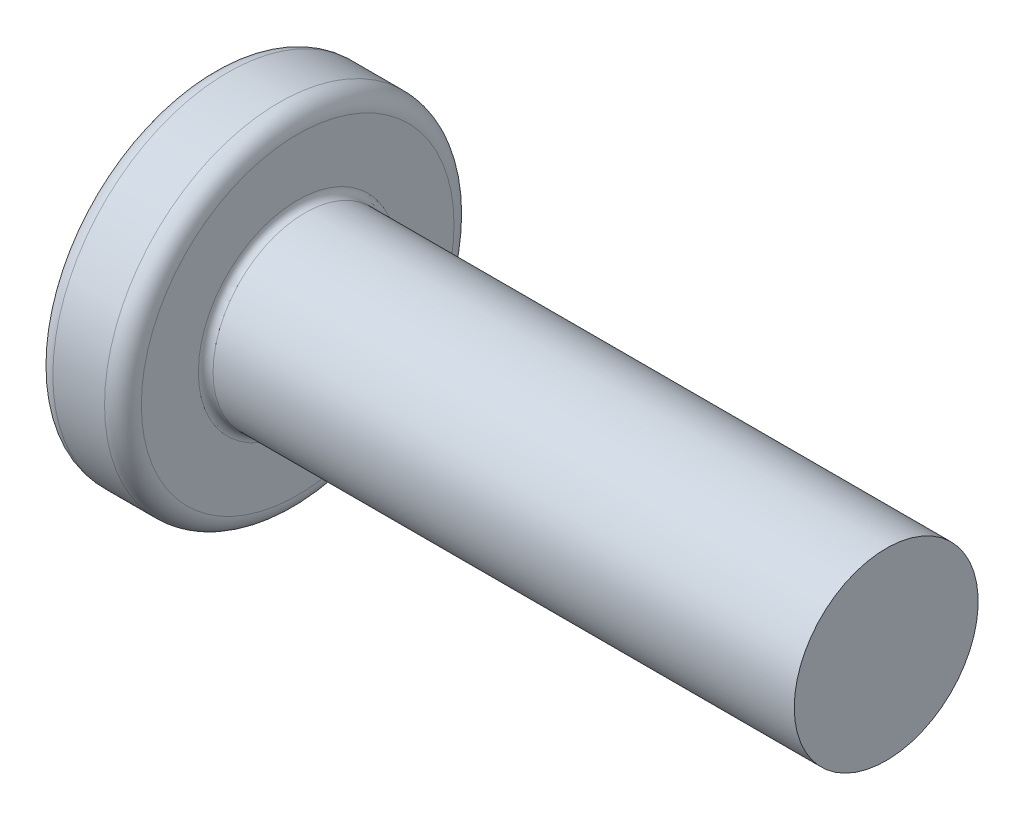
ISO-10303-21;
HEADER;
FILE_DESCRIPTION(('STEP AP214'),'2;1');
FILE_NAME('part.step','',(''),(''),'','','');
FILE_SCHEMA(('AUTOMOTIVE_DESIGN { 1 0 10303 214 1 1 1 1 }'));
ENDSEC;
DATA;
#1=APPLICATION_CONTEXT('core data for automotive mechanical design processes');
#2=APPLICATION_PROTOCOL_DEFINITION('international standard','automotive_design',2000,#1);
#3=PRODUCT_CONTEXT('',#1,'mechanical');
#4=PRODUCT('Part','Part','',(#3));
#5=PRODUCT_RELATED_PRODUCT_CATEGORY('part','',(#4));
#6=PRODUCT_DEFINITION_FORMATION('','',#4);
#7=PRODUCT_DEFINITION_CONTEXT('part definition',#1,'design');
#8=PRODUCT_DEFINITION('design','',#6,#7);
#9=PRODUCT_DEFINITION_SHAPE('','',#8);
#10=(LENGTH_UNIT() NAMED_UNIT(*) SI_UNIT(.MILLI.,.METRE.));
#11=(NAMED_UNIT(*) PLANE_ANGLE_UNIT() SI_UNIT($,.RADIAN.));
#12=(NAMED_UNIT(*) SI_UNIT($,.STERADIAN.) SOLID_ANGLE_UNIT());
#13=UNCERTAINTY_MEASURE_WITH_UNIT(LENGTH_MEASURE(1.E-05),#10,'distance_accuracy_value','');
#14=(GEOMETRIC_REPRESENTATION_CONTEXT(3) GLOBAL_UNCERTAINTY_ASSIGNED_CONTEXT((#13)) GLOBAL_UNIT_ASSIGNED_CONTEXT((#10,
#11,#12)) REPRESENTATION_CONTEXT('',''));
#15=CARTESIAN_POINT('',(0.,0.,0.));
#16=DIRECTION('',(0.,0.,1.));
#17=DIRECTION('',(1.,0.,0.));
#18=AXIS2_PLACEMENT_3D('',#15,#16,#17);
#19=CARTESIAN_POINT('',(8.,0.,0.));
#20=DIRECTION('',(-1.,0.,0.));
#21=DIRECTION('',(0.,1.,0.));
#22=AXIS2_PLACEMENT_3D('',#19,#20,#21);
#23=SPHERICAL_SURFACE('',#22,8.);
#24=CARTESIAN_POINT('',(1.42427123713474,0.,0.));
#25=DIRECTION('',(-1.,0.,0.));
#26=DIRECTION('',(0.,0.,1.));
#27=AXIS2_PLACEMENT_3D('',#24,#25,#26);
#28=CIRCLE('',#27,4.55629139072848);
#29=CARTESIAN_POINT('',(1.42427123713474,0.,4.55629139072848));
#30=VERTEX_POINT('',#29);
#31=EDGE_CURVE('E214',#30,#30,#28,.T.);
#32=ORIENTED_EDGE('',*,*,#31,.T.);
#33=EDGE_LOOP('',(#32));
#34=FACE_BOUND('',#33,.T.);
#35=CARTESIAN_POINT('',(0.0676093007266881,0.,0.));
#36=DIRECTION('',(1.,0.,0.));
#37=DIRECTION('',(0.,0.,-1.));
#38=AXIS2_PLACEMENT_3D('',#35,#36,#37);
#39=CIRCLE('',#38,1.03787176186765);
#40=CARTESIAN_POINT('',(0.0676093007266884,-0.514999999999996,-0.901084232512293));
#41=VERTEX_POINT('',#40);
#42=CARTESIAN_POINT('',(0.0676093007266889,-0.901084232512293,-0.515));
#43=VERTEX_POINT('',#42);
#44=EDGE_CURVE('E397',#41,#43,#39,.F.);
#45=ORIENTED_EDGE('',*,*,#44,.F.);
#46=CARTESIAN_POINT('',(8.,-0.515,0.));
#47=DIRECTION('',(0.,1.,0.));
#48=DIRECTION('',(0.,0.,1.));
#49=AXIS2_PLACEMENT_3D('',#46,#47,#48);
#50=CIRCLE('',#49,7.98340622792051);
#51=CARTESIAN_POINT('',(0.322606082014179,-0.514999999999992,-2.18915454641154));
#52=VERTEX_POINT('',#51);
#53=EDGE_CURVE('E356',#52,#41,#50,.T.);
#54=ORIENTED_EDGE('',*,*,#53,.F.);
#55=CARTESIAN_POINT('',(7.34565688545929,0.,1.31240929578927));
#56=DIRECTION('',(0.446197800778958,0.,-0.89493436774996));
#57=DIRECTION('',(-0.89493436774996,0.,-0.446197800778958));
#58=AXIS2_PLACEMENT_3D('',#55,#56,#57);
#59=CIRCLE('',#58,7.86444002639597);
#60=CARTESIAN_POINT('',(0.322606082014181,0.515000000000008,-2.18915454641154));
#61=VERTEX_POINT('',#60);
#62=EDGE_CURVE('E230',#52,#61,#59,.T.);
#63=ORIENTED_EDGE('',*,*,#62,.T.);
#64=CARTESIAN_POINT('',(8.,0.515,0.));
#65=DIRECTION('',(0.,-1.,0.));
#66=DIRECTION('',(0.,0.,-1.));
#67=AXIS2_PLACEMENT_3D('',#64,#65,#66);
#68=CIRCLE('',#67,7.98340622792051);
#69=CARTESIAN_POINT('',(0.0676093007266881,0.515000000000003,-0.901084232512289));
#70=VERTEX_POINT('',#69);
#71=EDGE_CURVE('E355',#70,#61,#68,.T.);
#72=ORIENTED_EDGE('',*,*,#71,.F.);
#73=CARTESIAN_POINT('',(0.0676093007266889,0.901084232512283,-0.515));
#74=VERTEX_POINT('',#73);
#75=EDGE_CURVE('E399',#74,#70,#39,.F.);
#76=ORIENTED_EDGE('',*,*,#75,.F.);
#77=CARTESIAN_POINT('',(8.,0.,-0.515));
#78=DIRECTION('',(0.,0.,1.));
#79=DIRECTION('',(1.,0.,0.));
#80=AXIS2_PLACEMENT_3D('',#77,#78,#79);
#81=CIRCLE('',#80,7.98340622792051);
#82=CARTESIAN_POINT('',(0.32260608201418,2.18915454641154,-0.515));
#83=VERTEX_POINT('',#82);
#84=EDGE_CURVE('E224',#83,#74,#81,.T.);
#85=ORIENTED_EDGE('',*,*,#84,.F.);
#86=CARTESIAN_POINT('',(7.34565688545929,-1.31240929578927,0.));
#87=DIRECTION('',(0.446197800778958,0.89493436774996,0.));
#88=DIRECTION('',(-0.89493436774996,0.446197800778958,0.));
#89=AXIS2_PLACEMENT_3D('',#86,#87,#88);
#90=CIRCLE('',#89,7.86444002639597);
#91=CARTESIAN_POINT('',(0.322606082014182,2.18915454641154,0.514999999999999));
#92=VERTEX_POINT('',#91);
#93=EDGE_CURVE('E227',#83,#92,#90,.T.);
#94=ORIENTED_EDGE('',*,*,#93,.T.);
#95=CARTESIAN_POINT('',(8.,0.,0.515));
#96=DIRECTION('',(0.,0.,-1.));
#97=DIRECTION('',(0.,1.,0.));
#98=AXIS2_PLACEMENT_3D('',#95,#96,#97);
#99=CIRCLE('',#98,7.98340622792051);
#100=CARTESIAN_POINT('',(0.0676093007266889,0.901084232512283,0.515));
#101=VERTEX_POINT('',#100);
#102=EDGE_CURVE('E220',#101,#92,#99,.T.);
#103=ORIENTED_EDGE('',*,*,#102,.F.);
#104=CARTESIAN_POINT('',(0.067609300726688,0.514999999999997,0.901084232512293));
#105=VERTEX_POINT('',#104);
#106=EDGE_CURVE('E403',#105,#101,#39,.F.);
#107=ORIENTED_EDGE('',*,*,#106,.F.);
#108=CARTESIAN_POINT('',(0.322606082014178,0.514999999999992,2.18915454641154));
#109=VERTEX_POINT('',#108);
#110=EDGE_CURVE('E352',#109,#105,#68,.T.);
#111=ORIENTED_EDGE('',*,*,#110,.F.);
#112=CARTESIAN_POINT('',(7.34565688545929,0.,-1.31240929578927));
#113=DIRECTION('',(0.446197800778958,0.,0.89493436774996));
#114=DIRECTION('',(0.89493436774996,0.,-0.446197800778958));
#115=AXIS2_PLACEMENT_3D('',#112,#113,#114);
#116=CIRCLE('',#115,7.86444002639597);
#117=CARTESIAN_POINT('',(0.32260608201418,-0.515000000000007,2.18915454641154));
#118=VERTEX_POINT('',#117);
#119=EDGE_CURVE('E233',#109,#118,#116,.T.);
#120=ORIENTED_EDGE('',*,*,#119,.T.);
#121=CARTESIAN_POINT('',(0.0676093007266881,-0.515000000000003,0.901084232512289));
#122=VERTEX_POINT('',#121);
#123=EDGE_CURVE('E357',#122,#118,#50,.T.);
#124=ORIENTED_EDGE('',*,*,#123,.F.);
#125=CARTESIAN_POINT('',(0.0676093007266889,-0.901084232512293,0.514999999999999));
#126=VERTEX_POINT('',#125);
#127=EDGE_CURVE('E289',#126,#122,#39,.F.);
#128=ORIENTED_EDGE('',*,*,#127,.F.);
#129=CARTESIAN_POINT('',(0.322606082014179,-2.18915454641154,0.514999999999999));
#130=VERTEX_POINT('',#129);
#131=EDGE_CURVE('E221',#130,#126,#99,.T.);
#132=ORIENTED_EDGE('',*,*,#131,.F.);
#133=CARTESIAN_POINT('',(7.34565688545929,1.31240929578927,0.));
#134=DIRECTION('',(0.446197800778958,-0.89493436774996,0.));
#135=DIRECTION('',(0.89493436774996,0.446197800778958,0.));
#136=AXIS2_PLACEMENT_3D('',#133,#134,#135);
#137=CIRCLE('',#136,7.86444002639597);
#138=CARTESIAN_POINT('',(0.322606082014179,-2.18915454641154,-0.515));
#139=VERTEX_POINT('',#138);
#140=EDGE_CURVE('E211',#130,#139,#137,.T.);
#141=ORIENTED_EDGE('',*,*,#140,.T.);
#142=EDGE_CURVE('E60',#43,#139,#81,.T.);
#143=ORIENTED_EDGE('',*,*,#142,.F.);
#144=EDGE_LOOP('',(#45,#54,#63,#72,#76,#85,#94,#103,#107,#111,#120,#124,#128,#132,#141,#143));
#145=FACE_BOUND('',#144,.T.);
#146=ADVANCED_FACE('F37',(#34,#145),#23,.T.);
#147=CARTESIAN_POINT('',(0.,2.35,-0.515));
#148=DIRECTION('',(0.,0.,1.));
#149=DIRECTION('',(1.,0.,0.));
#150=AXIS2_PLACEMENT_3D('',#147,#148,#149);
#151=PLANE('',#150);
#152=ORIENTED_EDGE('',*,*,#84,.T.);
#153=CARTESIAN_POINT('',(-1.51390484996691,1.02651837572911,-0.515));
#154=CARTESIAN_POINT('',(-1.19828075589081,1.00181934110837,-0.515));
#155=CARTESIAN_POINT('',(-0.882669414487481,0.976954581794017,-0.515));
#156=CARTESIAN_POINT('',(-0.251463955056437,0.926774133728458,-0.515));
#157=CARTESIAN_POINT('',(0.0641301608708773,0.901458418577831,-0.515));
#158=CARTESIAN_POINT('',(0.537487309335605,0.863059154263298,-0.515));
#159=CARTESIAN_POINT('',(0.695267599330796,0.850188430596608,-0.515));
#160=CARTESIAN_POINT('',(1.01081295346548,0.824283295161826,-0.515));
#161=CARTESIAN_POINT('',(1.16857801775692,0.811248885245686,-0.515));
#162=CARTESIAN_POINT('',(1.48408237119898,0.784992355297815,-0.515));
#163=CARTESIAN_POINT('',(1.64182166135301,0.771770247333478,-0.515));
#164=CARTESIAN_POINT('',(1.95728793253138,0.7451057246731,-0.515));
#165=CARTESIAN_POINT('',(2.11501491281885,0.731663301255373,-0.515));
#166=CARTESIAN_POINT('',(2.48551875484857,0.699781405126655,-0.515));
#167=CARTESIAN_POINT('',(2.69828652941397,0.681236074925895,-0.515));
#168=CARTESIAN_POINT('',(3.12376344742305,0.643549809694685,-0.515));
#169=CARTESIAN_POINT('',(3.33647259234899,0.624408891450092,-0.515));
#170=CARTESIAN_POINT('',(3.76177021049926,0.585350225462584,-0.515));
#171=CARTESIAN_POINT('',(3.97435870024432,0.565432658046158,-0.515));
#172=CARTESIAN_POINT('',(4.39945864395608,0.524537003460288,-0.515));
#173=CARTESIAN_POINT('',(4.61197008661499,0.503558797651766,-0.515));
#174=CARTESIAN_POINT('',(4.93071637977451,0.470931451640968,-0.515));
#175=CARTESIAN_POINT('',(5.03701000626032,0.459857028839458,-0.515));
#176=CARTESIAN_POINT('',(5.24954252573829,0.437229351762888,-0.515));
#177=CARTESIAN_POINT('',(5.35578142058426,0.425676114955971,-0.515));
#178=CARTESIAN_POINT('',(5.56815317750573,0.401967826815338,-0.515));
#179=CARTESIAN_POINT('',(5.6742860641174,0.389812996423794,-0.515));
#180=CARTESIAN_POINT('',(5.88647145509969,0.364705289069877,-0.515));
#181=CARTESIAN_POINT('',(5.99252394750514,0.35175231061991,-0.515));
#182=CARTESIAN_POINT('',(6.20462993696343,0.324739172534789,-0.515));
#183=CARTESIAN_POINT('',(6.31068325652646,0.310677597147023,-0.515));
#184=CARTESIAN_POINT('',(6.46957142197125,0.288366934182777,-0.515));
#185=CARTESIAN_POINT('',(6.52249184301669,0.280728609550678,-0.515));
#186=CARTESIAN_POINT('',(6.62826069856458,0.2649303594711,-0.515));
#187=CARTESIAN_POINT('',(6.68110912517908,0.256770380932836,-0.515));
#188=CARTESIAN_POINT('',(6.78677752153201,0.239755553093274,-0.515));
#189=CARTESIAN_POINT('',(6.83959732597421,0.230899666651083,-0.515));
#190=CARTESIAN_POINT('',(6.94505554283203,0.212240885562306,-0.515));
#191=CARTESIAN_POINT('',(6.99769400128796,0.202438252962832,-0.515));
#192=CARTESIAN_POINT('',(7.10276751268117,0.181407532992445,-0.515));
#193=CARTESIAN_POINT('',(7.1552022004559,0.17017756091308,-0.515));
#194=CARTESIAN_POINT('',(7.23345080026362,0.151498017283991,-0.515));
#195=CARTESIAN_POINT('',(7.25947836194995,0.144962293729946,-0.515));
#196=CARTESIAN_POINT('',(7.31128722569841,0.130937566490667,-0.515));
#197=CARTESIAN_POINT('',(7.33706839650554,0.123448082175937,-0.515));
#198=CARTESIAN_POINT('',(7.36266137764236,0.115313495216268,-0.515));
#199=B_SPLINE_CURVE_WITH_KNOTS('',3,(#153,#154,#155,#156,#157,#158,#159,#160,#161,#162,#163,
#164,#165,#166,#167,#168,#169,#170,#171,#172,#173,#174,#175,#176,#177,#178,#179,#180,#181,#182,
#183,#184,#185,#186,#187,#188,#189,#190,#191,#192,#193,#194,#195,#196,#197,#198),.UNSPECIFIED.,
.F.,.F.,(4,2,2,2,2,2,2,2,2,2,2,2,2,2,2,2,2,2,2,2,2,2,4),(0.,0.949767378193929,1.89959054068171,
2.37450359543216,2.84941128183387,3.32428857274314,3.79918470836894,4.43990748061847,
5.08061221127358,5.72116905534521,6.36179770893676,6.68240380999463,7.0029982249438,
7.32347575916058,7.64399412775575,7.96492866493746,8.12533319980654,8.28575408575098,
8.44641876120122,8.60703909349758,8.76787376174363,8.84836551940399,8.92889800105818),.UNSPECIFIED.);
#200=CARTESIAN_POINT('',(2.74,0.677477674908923,-0.515));
#201=VERTEX_POINT('',#200);
#202=EDGE_CURVE('E267',#74,#201,#199,.T.);
#203=ORIENTED_EDGE('',*,*,#202,.T.);
#204=DIRECTION('',(0.,1.,0.));
#205=VECTOR('',#204,1.);
#206=CARTESIAN_POINT('',(2.74,-0.983886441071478,-0.515));
#207=LINE('',#206,#205);
#208=CARTESIAN_POINT('',(2.74,0.983886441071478,-0.515));
#209=VERTEX_POINT('',#208);
#210=EDGE_CURVE('E343',#201,#209,#207,.T.);
#211=ORIENTED_EDGE('',*,*,#210,.T.);
#212=DIRECTION('',(0.89493436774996,-0.446197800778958,0.));
#213=VECTOR('',#212,1.);
#214=CARTESIAN_POINT('',(0.,2.35,-0.515));
#215=LINE('',#214,#213);
#216=EDGE_CURVE('E326',#83,#209,#215,.T.);
#217=ORIENTED_EDGE('',*,*,#216,.F.);
#218=EDGE_LOOP('',(#152,#203,#211,#217));
#219=FACE_BOUND('',#218,.T.);
#220=ADVANCED_FACE('F171',(#219),#151,.T.);
#221=CARTESIAN_POINT('',(2.74,-0.983886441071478,-0.515));
#222=VERTEX_POINT('',#221);
#223=CARTESIAN_POINT('',(2.74,-0.677477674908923,-0.515));
#224=VERTEX_POINT('',#223);
#225=EDGE_CURVE('E339',#222,#224,#207,.T.);
#226=ORIENTED_EDGE('',*,*,#225,.T.);
#227=CARTESIAN_POINT('',(-1.51390484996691,-1.02651837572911,-0.515));
#228=CARTESIAN_POINT('',(-1.19828075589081,-1.00181934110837,-0.515));
#229=CARTESIAN_POINT('',(-0.882669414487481,-0.976954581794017,-0.515));
#230=CARTESIAN_POINT('',(-0.251463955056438,-0.926774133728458,-0.515));
#231=CARTESIAN_POINT('',(0.0641301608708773,-0.901458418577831,-0.515));
#232=CARTESIAN_POINT('',(0.537487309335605,-0.863059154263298,-0.515));
#233=CARTESIAN_POINT('',(0.695267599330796,-0.850188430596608,-0.515));
#234=CARTESIAN_POINT('',(1.01081295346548,-0.824283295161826,-0.515));
#235=CARTESIAN_POINT('',(1.16857801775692,-0.811248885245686,-0.515));
#236=CARTESIAN_POINT('',(1.48408237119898,-0.784992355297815,-0.515));
#237=CARTESIAN_POINT('',(1.64182166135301,-0.771770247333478,-0.515));
#238=CARTESIAN_POINT('',(1.95728793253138,-0.7451057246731,-0.515));
#239=CARTESIAN_POINT('',(2.11501491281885,-0.731663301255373,-0.515));
#240=CARTESIAN_POINT('',(2.48551875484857,-0.699781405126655,-0.515));
#241=CARTESIAN_POINT('',(2.69828652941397,-0.681236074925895,-0.515));
#242=CARTESIAN_POINT('',(3.12376344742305,-0.643549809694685,-0.515));
#243=CARTESIAN_POINT('',(3.33647259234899,-0.624408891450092,-0.515));
#244=CARTESIAN_POINT('',(3.76177021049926,-0.585350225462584,-0.515));
#245=CARTESIAN_POINT('',(3.97435870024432,-0.565432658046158,-0.515));
#246=CARTESIAN_POINT('',(4.39945864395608,-0.524537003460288,-0.515));
#247=CARTESIAN_POINT('',(4.61197008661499,-0.503558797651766,-0.515));
#248=CARTESIAN_POINT('',(4.93071637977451,-0.470931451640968,-0.515));
#249=CARTESIAN_POINT('',(5.03701000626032,-0.459857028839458,-0.515));
#250=CARTESIAN_POINT('',(5.24954252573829,-0.437229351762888,-0.515));
#251=CARTESIAN_POINT('',(5.35578142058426,-0.425676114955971,-0.515));
#252=CARTESIAN_POINT('',(5.56815317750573,-0.401967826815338,-0.515));
#253=CARTESIAN_POINT('',(5.6742860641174,-0.389812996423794,-0.515));
#254=CARTESIAN_POINT('',(5.88647145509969,-0.364705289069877,-0.515));
#255=CARTESIAN_POINT('',(5.99252394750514,-0.35175231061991,-0.515));
#256=CARTESIAN_POINT('',(6.20462993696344,-0.324739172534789,-0.515));
#257=CARTESIAN_POINT('',(6.31068325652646,-0.310677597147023,-0.515));
#258=CARTESIAN_POINT('',(6.46957142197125,-0.288366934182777,-0.515));
#259=CARTESIAN_POINT('',(6.52249184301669,-0.280728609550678,-0.515));
#260=CARTESIAN_POINT('',(6.62826069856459,-0.2649303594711,-0.515));
#261=CARTESIAN_POINT('',(6.68110912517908,-0.256770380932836,-0.515));
#262=CARTESIAN_POINT('',(6.78677752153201,-0.239755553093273,-0.515));
#263=CARTESIAN_POINT('',(6.83959732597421,-0.230899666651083,-0.515));
#264=CARTESIAN_POINT('',(6.94505554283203,-0.212240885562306,-0.515));
#265=CARTESIAN_POINT('',(6.99769400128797,-0.202438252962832,-0.515));
#266=CARTESIAN_POINT('',(7.10276751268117,-0.181407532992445,-0.515));
#267=CARTESIAN_POINT('',(7.1552022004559,-0.170177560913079,-0.515));
#268=CARTESIAN_POINT('',(7.23345080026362,-0.15149801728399,-0.515));
#269=CARTESIAN_POINT('',(7.25947836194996,-0.144962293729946,-0.515));
#270=CARTESIAN_POINT('',(7.31128722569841,-0.130937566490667,-0.515));
#271=CARTESIAN_POINT('',(7.33706839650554,-0.123448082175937,-0.515));
#272=CARTESIAN_POINT('',(7.36266137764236,-0.115313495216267,-0.515));
#273=B_SPLINE_CURVE_WITH_KNOTS('',3,(#227,#228,#229,#230,#231,#232,#233,#234,#235,#236,#237,
#238,#239,#240,#241,#242,#243,#244,#245,#246,#247,#248,#249,#250,#251,#252,#253,#254,#255,#256,
#257,#258,#259,#260,#261,#262,#263,#264,#265,#266,#267,#268,#269,#270,#271,#272),.UNSPECIFIED.,
.F.,.F.,(4,2,2,2,2,2,2,2,2,2,2,2,2,2,2,2,2,2,2,2,2,2,4),(0.,0.949767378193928,1.89959054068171,
2.37450359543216,2.84941128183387,3.32428857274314,3.79918470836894,4.43990748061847,
5.08061221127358,5.72116905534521,6.36179770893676,6.68240380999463,7.0029982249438,
7.32347575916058,7.64399412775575,7.96492866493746,8.12533319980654,8.28575408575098,
8.44641876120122,8.60703909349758,8.76787376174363,8.84836551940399,8.92889800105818),.UNSPECIFIED.);
#274=EDGE_CURVE('E254',#224,#43,#273,.F.);
#275=ORIENTED_EDGE('',*,*,#274,.T.);
#276=ORIENTED_EDGE('',*,*,#142,.T.);
#277=DIRECTION('',(0.89493436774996,0.446197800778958,0.));
#278=VECTOR('',#277,1.);
#279=CARTESIAN_POINT('',(0.,-2.35,-0.515));
#280=LINE('',#279,#278);
#281=EDGE_CURVE('E332',#139,#222,#280,.T.);
#282=ORIENTED_EDGE('',*,*,#281,.T.);
#283=EDGE_LOOP('',(#226,#275,#276,#282));
#284=FACE_BOUND('',#283,.T.);
#285=ADVANCED_FACE('F177',(#284),#151,.T.);
#286=CARTESIAN_POINT('',(0.,-2.35,0.514999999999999));
#287=DIRECTION('',(0.,0.,-1.));
#288=DIRECTION('',(0.,1.,0.));
#289=AXIS2_PLACEMENT_3D('',#286,#287,#288);
#290=PLANE('',#289);
#291=DIRECTION('',(0.,-1.,0.));
#292=VECTOR('',#291,1.);
#293=CARTESIAN_POINT('',(2.74,0.983886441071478,0.515));
#294=LINE('',#293,#292);
#295=CARTESIAN_POINT('',(2.74,0.983886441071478,0.515));
#296=VERTEX_POINT('',#295);
#297=CARTESIAN_POINT('',(2.74,0.677477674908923,0.515));
#298=VERTEX_POINT('',#297);
#299=EDGE_CURVE('E347',#296,#298,#294,.T.);
#300=ORIENTED_EDGE('',*,*,#299,.T.);
#301=CARTESIAN_POINT('',(-1.51390485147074,1.02651837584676,0.514999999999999));
#302=CARTESIAN_POINT('',(-1.19828075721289,1.00181934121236,0.514999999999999));
#303=CARTESIAN_POINT('',(-0.882669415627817,0.976954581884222,0.514999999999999));
#304=CARTESIAN_POINT('',(-0.251463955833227,0.926774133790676,0.515));
#305=CARTESIAN_POINT('',(0.0641301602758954,0.901458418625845,0.515));
#306=CARTESIAN_POINT('',(0.537487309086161,0.863059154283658,0.515));
#307=CARTESIAN_POINT('',(0.695267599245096,0.85018843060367,0.515));
#308=CARTESIAN_POINT('',(1.01081295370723,0.824283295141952,0.515));
#309=CARTESIAN_POINT('',(1.16857801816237,0.811248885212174,0.515));
#310=CARTESIAN_POINT('',(1.48408237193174,0.784992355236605,0.515));
#311=CARTESIAN_POINT('',(1.64182166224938,0.771770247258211,0.515));
#312=CARTESIAN_POINT('',(1.95728793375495,0.745105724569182,0.515));
#313=CARTESIAN_POINT('',(2.11501491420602,0.731663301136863,0.515));
#314=CARTESIAN_POINT('',(2.48551875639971,0.699781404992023,0.515));
#315=CARTESIAN_POINT('',(2.6982865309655,0.681236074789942,0.515));
#316=CARTESIAN_POINT('',(3.12376344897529,0.643549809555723,0.515));
#317=CARTESIAN_POINT('',(3.33647259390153,0.624408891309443,0.515));
#318=CARTESIAN_POINT('',(3.76177021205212,0.585350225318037,0.515));
#319=CARTESIAN_POINT('',(3.97435870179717,0.5654326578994,0.515));
#320=CARTESIAN_POINT('',(4.39945864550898,0.524537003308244,0.515));
#321=CARTESIAN_POINT('',(4.61197008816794,0.503558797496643,0.515));
#322=CARTESIAN_POINT('',(4.9307163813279,0.470931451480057,0.515));
#323=CARTESIAN_POINT('',(5.03701000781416,0.459857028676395,0.515));
#324=CARTESIAN_POINT('',(5.24954252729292,0.437229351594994,0.515));
#325=CARTESIAN_POINT('',(5.35578142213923,0.4256761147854,0.515));
#326=CARTESIAN_POINT('',(5.56815317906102,0.401967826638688,0.515));
#327=CARTESIAN_POINT('',(5.67428606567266,0.389812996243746,0.515));
#328=CARTESIAN_POINT('',(5.88647145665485,0.36470528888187,0.515));
#329=CARTESIAN_POINT('',(5.99252394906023,0.351752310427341,0.515));
#330=CARTESIAN_POINT('',(6.204629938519,0.324739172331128,0.515));
#331=CARTESIAN_POINT('',(6.31068325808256,0.31067759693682,0.515));
#332=CARTESIAN_POINT('',(6.46957142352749,0.288366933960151,0.515));
#333=CARTESIAN_POINT('',(6.52249184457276,0.280728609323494,0.515));
#334=CARTESIAN_POINT('',(6.62826070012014,0.264930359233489,0.515));
#335=CARTESIAN_POINT('',(6.68110912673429,0.256770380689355,0.515));
#336=CARTESIAN_POINT('',(6.7867775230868,0.239755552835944,0.515));
#337=CARTESIAN_POINT('',(6.83959732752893,0.230899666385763,0.515));
#338=CARTESIAN_POINT('',(6.94505554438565,0.212240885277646,0.515));
#339=CARTESIAN_POINT('',(6.99769400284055,0.202438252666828,0.515));
#340=CARTESIAN_POINT('',(7.10276751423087,0.181407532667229,0.515));
#341=CARTESIAN_POINT('',(7.15520220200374,0.170177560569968,0.515));
#342=CARTESIAN_POINT('',(7.23345080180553,0.151498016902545,0.515));
#343=CARTESIAN_POINT('',(7.25947836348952,0.144962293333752,0.515));
#344=CARTESIAN_POINT('',(7.31128722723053,0.130937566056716,0.515));
#345=CARTESIAN_POINT('',(7.33706839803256,0.123448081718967,0.515));
#346=CARTESIAN_POINT('',(7.36266137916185,0.115313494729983,0.515));
#347=B_SPLINE_CURVE_WITH_KNOTS('',3,(#301,#302,#303,#304,#305,#306,#307,#308,#309,#310,#311,
#312,#313,#314,#315,#316,#317,#318,#319,#320,#321,#322,#323,#324,#325,#326,#327,#328,#329,#330,
#331,#332,#333,#334,#335,#336,#337,#338,#339,#340,#341,#342,#343,#344,#345,#346),.UNSPECIFIED.,
.F.,.F.,(4,2,2,2,2,2,2,2,2,2,2,2,2,2,2,2,2,2,2,2,2,2,4),(0.,0.949767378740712,1.89959054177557,
2.37450359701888,2.8494112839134,3.32428857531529,3.79918471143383,4.43990748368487,
5.08061221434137,5.7211690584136,6.36179771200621,6.68240381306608,7.00299822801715,
7.32347576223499,7.6439941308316,7.96492866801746,8.12533320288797,8.28575408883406,
8.44641876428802,8.6070390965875,8.76787376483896,8.84836552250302,8.92889800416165),.UNSPECIFIED.);
#348=EDGE_CURVE('E278',#298,#101,#347,.F.);
#349=ORIENTED_EDGE('',*,*,#348,.T.);
#350=ORIENTED_EDGE('',*,*,#102,.T.);
#351=DIRECTION('',(0.89493436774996,-0.446197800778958,0.));
#352=VECTOR('',#351,1.);
#353=CARTESIAN_POINT('',(0.,2.35,0.515));
#354=LINE('',#353,#352);
#355=EDGE_CURVE('E329',#92,#296,#354,.T.);
#356=ORIENTED_EDGE('',*,*,#355,.T.);
#357=EDGE_LOOP('',(#300,#349,#350,#356));
#358=FACE_BOUND('',#357,.T.);
#359=ADVANCED_FACE('F299',(#358),#290,.T.);
#360=ORIENTED_EDGE('',*,*,#131,.T.);
#361=CARTESIAN_POINT('',(-1.51390485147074,-1.02651837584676,0.514999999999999));
#362=CARTESIAN_POINT('',(-1.19828075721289,-1.00181934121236,0.514999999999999));
#363=CARTESIAN_POINT('',(-0.882669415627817,-0.976954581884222,0.514999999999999));
#364=CARTESIAN_POINT('',(-0.251463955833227,-0.926774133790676,0.514999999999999));
#365=CARTESIAN_POINT('',(0.0641301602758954,-0.901458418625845,0.514999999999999));
#366=CARTESIAN_POINT('',(0.537487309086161,-0.863059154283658,0.514999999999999));
#367=CARTESIAN_POINT('',(0.695267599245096,-0.850188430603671,0.514999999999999));
#368=CARTESIAN_POINT('',(1.01081295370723,-0.824283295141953,0.514999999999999));
#369=CARTESIAN_POINT('',(1.16857801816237,-0.811248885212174,0.514999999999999));
#370=CARTESIAN_POINT('',(1.48408237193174,-0.784992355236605,0.514999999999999));
#371=CARTESIAN_POINT('',(1.64182166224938,-0.771770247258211,0.514999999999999));
#372=CARTESIAN_POINT('',(1.95728793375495,-0.745105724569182,0.514999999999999));
#373=CARTESIAN_POINT('',(2.11501491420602,-0.731663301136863,0.515));
#374=CARTESIAN_POINT('',(2.48551875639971,-0.699781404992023,0.515));
#375=CARTESIAN_POINT('',(2.6982865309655,-0.681236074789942,0.515));
#376=CARTESIAN_POINT('',(3.12376344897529,-0.643549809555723,0.515));
#377=CARTESIAN_POINT('',(3.33647259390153,-0.624408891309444,0.515));
#378=CARTESIAN_POINT('',(3.76177021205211,-0.585350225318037,0.515));
#379=CARTESIAN_POINT('',(3.97435870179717,-0.565432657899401,0.515));
#380=CARTESIAN_POINT('',(4.39945864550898,-0.524537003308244,0.515));
#381=CARTESIAN_POINT('',(4.61197008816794,-0.503558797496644,0.515));
#382=CARTESIAN_POINT('',(4.9307163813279,-0.470931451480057,0.515));
#383=CARTESIAN_POINT('',(5.03701000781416,-0.459857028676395,0.515));
#384=CARTESIAN_POINT('',(5.24954252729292,-0.437229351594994,0.515));
#385=CARTESIAN_POINT('',(5.35578142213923,-0.4256761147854,0.515));
#386=CARTESIAN_POINT('',(5.56815317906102,-0.401967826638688,0.515));
#387=CARTESIAN_POINT('',(5.67428606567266,-0.389812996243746,0.515));
#388=CARTESIAN_POINT('',(5.88647145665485,-0.36470528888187,0.515));
#389=CARTESIAN_POINT('',(5.99252394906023,-0.351752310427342,0.515));
#390=CARTESIAN_POINT('',(6.20462993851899,-0.324739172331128,0.515));
#391=CARTESIAN_POINT('',(6.31068325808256,-0.31067759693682,0.515));
#392=CARTESIAN_POINT('',(6.46957142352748,-0.288366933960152,0.515));
#393=CARTESIAN_POINT('',(6.52249184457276,-0.280728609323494,0.515));
#394=CARTESIAN_POINT('',(6.62826070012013,-0.26493035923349,0.515));
#395=CARTESIAN_POINT('',(6.68110912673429,-0.256770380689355,0.515));
#396=CARTESIAN_POINT('',(6.7867775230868,-0.239755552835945,0.515));
#397=CARTESIAN_POINT('',(6.83959732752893,-0.230899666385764,0.515));
#398=CARTESIAN_POINT('',(6.94505554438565,-0.212240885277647,0.515));
#399=CARTESIAN_POINT('',(6.99769400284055,-0.202438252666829,0.515));
#400=CARTESIAN_POINT('',(7.10276751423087,-0.181407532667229,0.515));
#401=CARTESIAN_POINT('',(7.15520220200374,-0.170177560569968,0.515));
#402=CARTESIAN_POINT('',(7.23345080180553,-0.151498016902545,0.515));
#403=CARTESIAN_POINT('',(7.25947836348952,-0.144962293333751,0.515));
#404=CARTESIAN_POINT('',(7.31128722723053,-0.130937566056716,0.515));
#405=CARTESIAN_POINT('',(7.33706839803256,-0.123448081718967,0.515));
#406=CARTESIAN_POINT('',(7.36266137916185,-0.115313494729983,0.515));
#407=B_SPLINE_CURVE_WITH_KNOTS('',3,(#361,#362,#363,#364,#365,#366,#367,#368,#369,#370,#371,
#372,#373,#374,#375,#376,#377,#378,#379,#380,#381,#382,#383,#384,#385,#386,#387,#388,#389,#390,
#391,#392,#393,#394,#395,#396,#397,#398,#399,#400,#401,#402,#403,#404,#405,#406),.UNSPECIFIED.,
.F.,.F.,(4,2,2,2,2,2,2,2,2,2,2,2,2,2,2,2,2,2,2,2,2,2,4),(0.,0.949767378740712,1.89959054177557,
2.37450359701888,2.8494112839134,3.32428857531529,3.79918471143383,4.43990748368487,
5.08061221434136,5.72116905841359,6.36179771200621,6.68240381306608,7.00299822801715,
7.32347576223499,7.6439941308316,7.96492866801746,8.12533320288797,8.28575408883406,
8.44641876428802,8.6070390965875,8.76787376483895,8.84836552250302,8.92889800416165),.UNSPECIFIED.);
#408=CARTESIAN_POINT('',(2.74,-0.677477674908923,0.515));
#409=VERTEX_POINT('',#408);
#410=EDGE_CURVE('E290',#126,#409,#407,.T.);
#411=ORIENTED_EDGE('',*,*,#410,.T.);
#412=CARTESIAN_POINT('',(2.74,-0.983886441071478,0.515));
#413=VERTEX_POINT('',#412);
#414=EDGE_CURVE('E346',#409,#413,#294,.T.);
#415=ORIENTED_EDGE('',*,*,#414,.T.);
#416=DIRECTION('',(0.89493436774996,0.446197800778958,0.));
#417=VECTOR('',#416,1.);
#418=CARTESIAN_POINT('',(0.,-2.35,0.514999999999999));
#419=LINE('',#418,#417);
#420=EDGE_CURVE('E335',#130,#413,#419,.T.);
#421=ORIENTED_EDGE('',*,*,#420,.F.);
#422=EDGE_LOOP('',(#360,#411,#415,#421));
#423=FACE_BOUND('',#422,.T.);
#424=ADVANCED_FACE('F303',(#423),#290,.T.);
#425=CARTESIAN_POINT('',(2.74,-0.983886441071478,-0.515));
#426=DIRECTION('',(1.,0.,0.));
#427=DIRECTION('',(0.,0.,-1.));
#428=AXIS2_PLACEMENT_3D('',#425,#426,#427);
#429=PLANE('',#428);
#430=CARTESIAN_POINT('',(2.74,0.,0.));
#431=DIRECTION('',(-1.,0.,0.));
#432=DIRECTION('',(0.,0.,1.));
#433=AXIS2_PLACEMENT_3D('',#430,#431,#432);
#434=CIRCLE('',#433,0.851);
#435=EDGE_CURVE('E437',#224,#409,#434,.T.);
#436=ORIENTED_EDGE('',*,*,#435,.F.);
#437=ORIENTED_EDGE('',*,*,#225,.F.);
#438=DIRECTION('',(0.,0.,1.));
#439=VECTOR('',#438,1.);
#440=CARTESIAN_POINT('',(2.74,-0.983886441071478,-0.515));
#441=LINE('',#440,#439);
#442=EDGE_CURVE('E338',#222,#413,#441,.T.);
#443=ORIENTED_EDGE('',*,*,#442,.T.);
#444=ORIENTED_EDGE('',*,*,#414,.F.);
#445=EDGE_LOOP('',(#436,#437,#443,#444));
#446=FACE_BOUND('',#445,.T.);
#447=ADVANCED_FACE('F459',(#446),#429,.F.);
#448=CARTESIAN_POINT('',(2.74,-0.515000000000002,0.677477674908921));
#449=VERTEX_POINT('',#448);
#450=CARTESIAN_POINT('',(2.74,0.514999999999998,0.677477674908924));
#451=VERTEX_POINT('',#450);
#452=EDGE_CURVE('E402',#449,#451,#434,.T.);
#453=ORIENTED_EDGE('',*,*,#452,.F.);
#454=DIRECTION('',(0.,0.,-1.));
#455=VECTOR('',#454,1.);
#456=CARTESIAN_POINT('',(2.74,-0.515000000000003,0.983886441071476));
#457=LINE('',#456,#455);
#458=CARTESIAN_POINT('',(2.74,-0.515000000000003,0.983886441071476));
#459=VERTEX_POINT('',#458);
#460=EDGE_CURVE('E375',#459,#449,#457,.T.);
#461=ORIENTED_EDGE('',*,*,#460,.F.);
#462=DIRECTION('',(0.,1.,0.));
#463=VECTOR('',#462,1.);
#464=CARTESIAN_POINT('',(2.74,-0.515000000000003,0.983886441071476));
#465=LINE('',#464,#463);
#466=CARTESIAN_POINT('',(2.74,0.514999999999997,0.98388644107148));
#467=VERTEX_POINT('',#466);
#468=EDGE_CURVE('E372',#459,#467,#465,.T.);
#469=ORIENTED_EDGE('',*,*,#468,.T.);
#470=DIRECTION('',(0.,0.,1.));
#471=VECTOR('',#470,1.);
#472=CARTESIAN_POINT('',(2.74,0.515000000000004,-0.983886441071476));
#473=LINE('',#472,#471);
#474=EDGE_CURVE('E296',#451,#467,#473,.T.);
#475=ORIENTED_EDGE('',*,*,#474,.F.);
#476=EDGE_LOOP('',(#453,#461,#469,#475));
#477=FACE_BOUND('',#476,.T.);
#478=ADVANCED_FACE('F418',(#477),#429,.F.);
#479=EDGE_CURVE('E400',#298,#201,#434,.T.);
#480=ORIENTED_EDGE('',*,*,#479,.F.);
#481=ORIENTED_EDGE('',*,*,#299,.F.);
#482=DIRECTION('',(0.,0.,-1.));
#483=VECTOR('',#482,1.);
#484=CARTESIAN_POINT('',(2.74,0.983886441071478,0.515));
#485=LINE('',#484,#483);
#486=EDGE_CURVE('E342',#296,#209,#485,.T.);
#487=ORIENTED_EDGE('',*,*,#486,.T.);
#488=ORIENTED_EDGE('',*,*,#210,.F.);
#489=EDGE_LOOP('',(#480,#481,#487,#488));
#490=FACE_BOUND('',#489,.T.);
#491=ADVANCED_FACE('F433',(#490),#429,.F.);
#492=CARTESIAN_POINT('',(2.74,0.515000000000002,-0.677477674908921));
#493=VERTEX_POINT('',#492);
#494=CARTESIAN_POINT('',(2.74,-0.514999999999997,-0.677477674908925));
#495=VERTEX_POINT('',#494);
#496=EDGE_CURVE('E52',#493,#495,#434,.T.);
#497=ORIENTED_EDGE('',*,*,#496,.F.);
#498=CARTESIAN_POINT('',(2.74,0.515000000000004,-0.983886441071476));
#499=VERTEX_POINT('',#498);
#500=EDGE_CURVE('E369',#499,#493,#473,.T.);
#501=ORIENTED_EDGE('',*,*,#500,.F.);
#502=DIRECTION('',(0.,-1.,0.));
#503=VECTOR('',#502,1.);
#504=CARTESIAN_POINT('',(2.74,0.515000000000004,-0.983886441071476));
#505=LINE('',#504,#503);
#506=CARTESIAN_POINT('',(2.74,-0.514999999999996,-0.983886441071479));
#507=VERTEX_POINT('',#506);
#508=EDGE_CURVE('E297',#499,#507,#505,.T.);
#509=ORIENTED_EDGE('',*,*,#508,.T.);
#510=EDGE_CURVE('E374',#495,#507,#457,.T.);
#511=ORIENTED_EDGE('',*,*,#510,.F.);
#512=EDGE_LOOP('',(#497,#501,#509,#511));
#513=FACE_BOUND('',#512,.T.);
#514=ADVANCED_FACE('F390',(#513),#429,.F.);
#515=CARTESIAN_POINT('',(0.,-0.514999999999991,-2.35));
#516=DIRECTION('',(0.,1.,0.));
#517=DIRECTION('',(0.,0.,1.));
#518=AXIS2_PLACEMENT_3D('',#515,#516,#517);
#519=PLANE('',#518);
#520=ORIENTED_EDGE('',*,*,#460,.T.);
#521=CARTESIAN_POINT('',(-1.51390485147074,-0.515000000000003,1.02651837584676));
#522=CARTESIAN_POINT('',(-1.19828075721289,-0.515000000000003,1.00181934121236));
#523=CARTESIAN_POINT('',(-0.882669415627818,-0.515000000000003,0.97695458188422));
#524=CARTESIAN_POINT('',(-0.251463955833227,-0.515000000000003,0.926774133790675));
#525=CARTESIAN_POINT('',(0.0641301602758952,-0.515000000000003,0.901458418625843));
#526=CARTESIAN_POINT('',(0.537487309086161,-0.515000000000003,0.863059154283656));
#527=CARTESIAN_POINT('',(0.695267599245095,-0.515000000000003,0.850188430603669));
#528=CARTESIAN_POINT('',(1.01081295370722,-0.515000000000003,0.824283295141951));
#529=CARTESIAN_POINT('',(1.16857801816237,-0.515000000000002,0.811248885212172));
#530=CARTESIAN_POINT('',(1.48408237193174,-0.515000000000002,0.784992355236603));
#531=CARTESIAN_POINT('',(1.64182166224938,-0.515000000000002,0.771770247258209));
#532=CARTESIAN_POINT('',(1.95728793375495,-0.515000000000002,0.74510572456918));
#533=CARTESIAN_POINT('',(2.11501491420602,-0.515000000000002,0.731663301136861));
#534=CARTESIAN_POINT('',(2.48551875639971,-0.515000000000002,0.699781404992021));
#535=CARTESIAN_POINT('',(2.6982865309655,-0.515000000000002,0.68123607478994));
#536=CARTESIAN_POINT('',(3.12376344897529,-0.515000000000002,0.643549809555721));
#537=CARTESIAN_POINT('',(3.33647259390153,-0.515000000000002,0.624408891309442));
#538=CARTESIAN_POINT('',(3.76177021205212,-0.515000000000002,0.585350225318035));
#539=CARTESIAN_POINT('',(3.97435870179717,-0.515000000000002,0.565432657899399));
#540=CARTESIAN_POINT('',(4.39945864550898,-0.515000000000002,0.524537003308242));
#541=CARTESIAN_POINT('',(4.61197008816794,-0.515000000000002,0.503558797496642));
#542=CARTESIAN_POINT('',(4.9307163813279,-0.515000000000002,0.470931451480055));
#543=CARTESIAN_POINT('',(5.03701000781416,-0.515000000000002,0.459857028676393));
#544=CARTESIAN_POINT('',(5.24954252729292,-0.515000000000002,0.437229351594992));
#545=CARTESIAN_POINT('',(5.35578142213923,-0.515000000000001,0.425676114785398));
#546=CARTESIAN_POINT('',(5.56815317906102,-0.515000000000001,0.401967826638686));
#547=CARTESIAN_POINT('',(5.67428606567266,-0.515000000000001,0.389812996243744));
#548=CARTESIAN_POINT('',(5.88647145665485,-0.515000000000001,0.364705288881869));
#549=CARTESIAN_POINT('',(5.99252394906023,-0.515000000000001,0.35175231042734));
#550=CARTESIAN_POINT('',(6.204629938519,-0.515000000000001,0.324739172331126));
#551=CARTESIAN_POINT('',(6.31068325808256,-0.515000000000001,0.310677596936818));
#552=CARTESIAN_POINT('',(6.46957142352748,-0.515000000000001,0.28836693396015));
#553=CARTESIAN_POINT('',(6.52249184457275,-0.515000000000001,0.280728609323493));
#554=CARTESIAN_POINT('',(6.62826070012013,-0.515000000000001,0.264930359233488));
#555=CARTESIAN_POINT('',(6.68110912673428,-0.515000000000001,0.256770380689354));
#556=CARTESIAN_POINT('',(6.7867775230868,-0.515000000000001,0.239755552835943));
#557=CARTESIAN_POINT('',(6.83959732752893,-0.515000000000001,0.230899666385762));
#558=CARTESIAN_POINT('',(6.94505554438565,-0.515000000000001,0.212240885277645));
#559=CARTESIAN_POINT('',(6.99769400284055,-0.515000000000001,0.202438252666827));
#560=CARTESIAN_POINT('',(7.10276751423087,-0.515000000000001,0.181407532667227));
#561=CARTESIAN_POINT('',(7.15520220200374,-0.515000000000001,0.170177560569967));
#562=CARTESIAN_POINT('',(7.23345080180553,-0.515000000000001,0.151498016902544));
#563=CARTESIAN_POINT('',(7.25947836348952,-0.515000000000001,0.14496229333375));
#564=CARTESIAN_POINT('',(7.31128722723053,-0.515000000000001,0.130937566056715));
#565=CARTESIAN_POINT('',(7.33706839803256,-0.515000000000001,0.123448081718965));
#566=CARTESIAN_POINT('',(7.36266137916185,-0.515000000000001,0.115313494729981));
#567=B_SPLINE_CURVE_WITH_KNOTS('',3,(#521,#522,#523,#524,#525,#526,#527,#528,#529,#530,#531,
#532,#533,#534,#535,#536,#537,#538,#539,#540,#541,#542,#543,#544,#545,#546,#547,#548,#549,#550,
#551,#552,#553,#554,#555,#556,#557,#558,#559,#560,#561,#562,#563,#564,#565,#566),.UNSPECIFIED.,
.F.,.F.,(4,2,2,2,2,2,2,2,2,2,2,2,2,2,2,2,2,2,2,2,2,2,4),(0.,0.949767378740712,1.89959054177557,
2.37450359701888,2.8494112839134,3.32428857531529,3.79918471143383,4.43990748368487,
5.08061221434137,5.7211690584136,6.36179771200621,6.68240381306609,7.00299822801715,
7.32347576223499,7.6439941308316,7.96492866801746,8.12533320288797,8.28575408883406,
8.44641876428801,8.6070390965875,8.76787376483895,8.84836552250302,8.92889800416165),.UNSPECIFIED.);
#568=EDGE_CURVE('E284',#449,#122,#567,.F.);
#569=ORIENTED_EDGE('',*,*,#568,.T.);
#570=ORIENTED_EDGE('',*,*,#123,.T.);
#571=DIRECTION('',(0.89493436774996,0.,-0.446197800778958));
#572=VECTOR('',#571,1.);
#573=CARTESIAN_POINT('',(0.,-0.515000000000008,2.35));
#574=LINE('',#573,#572);
#575=EDGE_CURVE('E360',#118,#459,#574,.T.);
#576=ORIENTED_EDGE('',*,*,#575,.T.);
#577=EDGE_LOOP('',(#520,#569,#570,#576));
#578=FACE_BOUND('',#577,.T.);
#579=ADVANCED_FACE('F242',(#578),#519,.T.);
#580=CARTESIAN_POINT('',(0.,0.514999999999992,2.35));
#581=DIRECTION('',(0.,-1.,0.));
#582=DIRECTION('',(1.,0.,0.));
#583=AXIS2_PLACEMENT_3D('',#580,#581,#582);
#584=PLANE('',#583);
#585=ORIENTED_EDGE('',*,*,#110,.T.);
#586=CARTESIAN_POINT('',(-1.51390484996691,0.514999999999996,1.02651837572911));
#587=CARTESIAN_POINT('',(-1.19828075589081,0.514999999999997,1.00181934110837));
#588=CARTESIAN_POINT('',(-0.882669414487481,0.514999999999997,0.976954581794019));
#589=CARTESIAN_POINT('',(-0.251463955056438,0.514999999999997,0.92677413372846));
#590=CARTESIAN_POINT('',(0.0641301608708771,0.514999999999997,0.901458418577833));
#591=CARTESIAN_POINT('',(0.537487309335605,0.514999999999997,0.8630591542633));
#592=CARTESIAN_POINT('',(0.695267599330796,0.514999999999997,0.850188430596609));
#593=CARTESIAN_POINT('',(1.01081295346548,0.514999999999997,0.824283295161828));
#594=CARTESIAN_POINT('',(1.16857801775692,0.514999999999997,0.811248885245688));
#595=CARTESIAN_POINT('',(1.48408237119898,0.514999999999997,0.784992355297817));
#596=CARTESIAN_POINT('',(1.64182166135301,0.514999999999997,0.77177024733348));
#597=CARTESIAN_POINT('',(1.95728793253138,0.514999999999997,0.745105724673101));
#598=CARTESIAN_POINT('',(2.11501491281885,0.514999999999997,0.731663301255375));
#599=CARTESIAN_POINT('',(2.48551875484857,0.514999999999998,0.699781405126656));
#600=CARTESIAN_POINT('',(2.69828652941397,0.514999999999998,0.681236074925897));
#601=CARTESIAN_POINT('',(3.12376344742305,0.514999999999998,0.643549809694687));
#602=CARTESIAN_POINT('',(3.33647259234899,0.514999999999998,0.624408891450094));
#603=CARTESIAN_POINT('',(3.76177021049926,0.514999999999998,0.585350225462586));
#604=CARTESIAN_POINT('',(3.97435870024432,0.514999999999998,0.56543265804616));
#605=CARTESIAN_POINT('',(4.39945864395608,0.514999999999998,0.524537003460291));
#606=CARTESIAN_POINT('',(4.61197008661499,0.514999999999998,0.503558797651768));
#607=CARTESIAN_POINT('',(4.93071637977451,0.514999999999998,0.47093145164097));
#608=CARTESIAN_POINT('',(5.03701000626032,0.514999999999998,0.459857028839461));
#609=CARTESIAN_POINT('',(5.24954252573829,0.514999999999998,0.43722935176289));
#610=CARTESIAN_POINT('',(5.35578142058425,0.514999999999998,0.425676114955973));
#611=CARTESIAN_POINT('',(5.56815317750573,0.514999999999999,0.40196782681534));
#612=CARTESIAN_POINT('',(5.6742860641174,0.514999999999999,0.389812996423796));
#613=CARTESIAN_POINT('',(5.88647145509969,0.514999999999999,0.364705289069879));
#614=CARTESIAN_POINT('',(5.99252394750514,0.514999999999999,0.351752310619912));
#615=CARTESIAN_POINT('',(6.20462993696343,0.514999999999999,0.324739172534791));
#616=CARTESIAN_POINT('',(6.31068325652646,0.514999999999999,0.310677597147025));
#617=CARTESIAN_POINT('',(6.46957142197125,0.514999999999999,0.288366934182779));
#618=CARTESIAN_POINT('',(6.52249184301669,0.514999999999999,0.28072860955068));
#619=CARTESIAN_POINT('',(6.62826069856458,0.514999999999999,0.264930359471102));
#620=CARTESIAN_POINT('',(6.68110912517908,0.514999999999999,0.256770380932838));
#621=CARTESIAN_POINT('',(6.78677752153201,0.514999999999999,0.239755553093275));
#622=CARTESIAN_POINT('',(6.83959732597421,0.514999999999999,0.230899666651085));
#623=CARTESIAN_POINT('',(6.94505554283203,0.514999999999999,0.212240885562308));
#624=CARTESIAN_POINT('',(6.99769400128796,0.514999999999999,0.202438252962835));
#625=CARTESIAN_POINT('',(7.10276751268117,0.514999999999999,0.181407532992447));
#626=CARTESIAN_POINT('',(7.1552022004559,0.514999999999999,0.170177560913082));
#627=CARTESIAN_POINT('',(7.23345080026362,0.514999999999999,0.151498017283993));
#628=CARTESIAN_POINT('',(7.25947836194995,0.514999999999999,0.144962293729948));
#629=CARTESIAN_POINT('',(7.31128722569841,0.514999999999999,0.130937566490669));
#630=CARTESIAN_POINT('',(7.33706839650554,0.514999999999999,0.12344808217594));
#631=CARTESIAN_POINT('',(7.36266137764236,0.515,0.11531349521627));
#632=B_SPLINE_CURVE_WITH_KNOTS('',3,(#586,#587,#588,#589,#590,#591,#592,#593,#594,#595,#596,
#597,#598,#599,#600,#601,#602,#603,#604,#605,#606,#607,#608,#609,#610,#611,#612,#613,#614,#615,
#616,#617,#618,#619,#620,#621,#622,#623,#624,#625,#626,#627,#628,#629,#630,#631),.UNSPECIFIED.,
.F.,.F.,(4,2,2,2,2,2,2,2,2,2,2,2,2,2,2,2,2,2,2,2,2,2,4),(0.,0.949767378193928,1.89959054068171,
2.37450359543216,2.84941128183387,3.32428857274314,3.79918470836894,4.43990748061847,
5.08061221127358,5.72116905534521,6.36179770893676,6.68240380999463,7.0029982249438,
7.32347575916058,7.64399412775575,7.96492866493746,8.12533319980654,8.28575408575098,
8.44641876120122,8.60703909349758,8.76787376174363,8.84836551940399,8.92889800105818),.UNSPECIFIED.);
#633=EDGE_CURVE('E273',#105,#451,#632,.T.);
#634=ORIENTED_EDGE('',*,*,#633,.T.);
#635=ORIENTED_EDGE('',*,*,#474,.T.);
#636=DIRECTION('',(0.89493436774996,0.,-0.446197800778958));
#637=VECTOR('',#636,1.);
#638=CARTESIAN_POINT('',(0.,0.514999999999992,2.35));
#639=LINE('',#638,#637);
#640=EDGE_CURVE('E359',#109,#467,#639,.T.);
#641=ORIENTED_EDGE('',*,*,#640,.F.);
#642=EDGE_LOOP('',(#585,#634,#635,#641));
#643=FACE_BOUND('',#642,.T.);
#644=ADVANCED_FACE('F412',(#643),#584,.T.);
#645=ORIENTED_EDGE('',*,*,#500,.T.);
#646=CARTESIAN_POINT('',(-1.51390485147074,0.515000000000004,-1.02651837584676));
#647=CARTESIAN_POINT('',(-1.19828075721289,0.515000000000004,-1.00181934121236));
#648=CARTESIAN_POINT('',(-0.882669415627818,0.515000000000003,-0.97695458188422));
#649=CARTESIAN_POINT('',(-0.251463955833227,0.515000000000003,-0.926774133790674));
#650=CARTESIAN_POINT('',(0.0641301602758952,0.515000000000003,-0.901458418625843));
#651=CARTESIAN_POINT('',(0.537487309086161,0.515000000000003,-0.863059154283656));
#652=CARTESIAN_POINT('',(0.695267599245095,0.515000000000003,-0.850188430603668));
#653=CARTESIAN_POINT('',(1.01081295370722,0.515000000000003,-0.82428329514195));
#654=CARTESIAN_POINT('',(1.16857801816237,0.515000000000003,-0.811248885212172));
#655=CARTESIAN_POINT('',(1.48408237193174,0.515000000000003,-0.784992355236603));
#656=CARTESIAN_POINT('',(1.64182166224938,0.515000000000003,-0.771770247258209));
#657=CARTESIAN_POINT('',(1.95728793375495,0.515000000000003,-0.74510572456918));
#658=CARTESIAN_POINT('',(2.11501491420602,0.515000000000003,-0.731663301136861));
#659=CARTESIAN_POINT('',(2.48551875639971,0.515000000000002,-0.699781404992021));
#660=CARTESIAN_POINT('',(2.6982865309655,0.515000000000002,-0.68123607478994));
#661=CARTESIAN_POINT('',(3.12376344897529,0.515000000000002,-0.643549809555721));
#662=CARTESIAN_POINT('',(3.33647259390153,0.515000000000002,-0.624408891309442));
#663=CARTESIAN_POINT('',(3.76177021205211,0.515000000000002,-0.585350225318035));
#664=CARTESIAN_POINT('',(3.97435870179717,0.515000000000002,-0.565432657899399));
#665=CARTESIAN_POINT('',(4.39945864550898,0.515000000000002,-0.524537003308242));
#666=CARTESIAN_POINT('',(4.61197008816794,0.515000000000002,-0.503558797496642));
#667=CARTESIAN_POINT('',(4.9307163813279,0.515000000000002,-0.470931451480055));
#668=CARTESIAN_POINT('',(5.03701000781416,0.515000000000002,-0.459857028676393));
#669=CARTESIAN_POINT('',(5.24954252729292,0.515000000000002,-0.437229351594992));
#670=CARTESIAN_POINT('',(5.35578142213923,0.515000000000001,-0.425676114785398));
#671=CARTESIAN_POINT('',(5.56815317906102,0.515000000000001,-0.401967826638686));
#672=CARTESIAN_POINT('',(5.67428606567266,0.515000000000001,-0.389812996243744));
#673=CARTESIAN_POINT('',(5.88647145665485,0.515000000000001,-0.364705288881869));
#674=CARTESIAN_POINT('',(5.99252394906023,0.515000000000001,-0.35175231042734));
#675=CARTESIAN_POINT('',(6.20462993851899,0.515000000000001,-0.324739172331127));
#676=CARTESIAN_POINT('',(6.31068325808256,0.515000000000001,-0.310677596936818));
#677=CARTESIAN_POINT('',(6.46957142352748,0.515000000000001,-0.28836693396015));
#678=CARTESIAN_POINT('',(6.52249184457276,0.515000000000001,-0.280728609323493));
#679=CARTESIAN_POINT('',(6.62826070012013,0.515000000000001,-0.264930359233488));
#680=CARTESIAN_POINT('',(6.68110912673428,0.515000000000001,-0.256770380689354));
#681=CARTESIAN_POINT('',(6.7867775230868,0.515000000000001,-0.239755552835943));
#682=CARTESIAN_POINT('',(6.83959732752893,0.515000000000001,-0.230899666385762));
#683=CARTESIAN_POINT('',(6.94505554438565,0.515000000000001,-0.212240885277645));
#684=CARTESIAN_POINT('',(6.99769400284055,0.515000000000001,-0.202438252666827));
#685=CARTESIAN_POINT('',(7.10276751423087,0.515000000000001,-0.181407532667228));
#686=CARTESIAN_POINT('',(7.15520220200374,0.515000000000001,-0.170177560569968));
#687=CARTESIAN_POINT('',(7.23345080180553,0.515000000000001,-0.151498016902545));
#688=CARTESIAN_POINT('',(7.25947836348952,0.515,-0.144962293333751));
#689=CARTESIAN_POINT('',(7.31128722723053,0.515,-0.130937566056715));
#690=CARTESIAN_POINT('',(7.33706839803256,0.515,-0.123448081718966));
#691=CARTESIAN_POINT('',(7.36266137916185,0.515,-0.115313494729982));
#692=B_SPLINE_CURVE_WITH_KNOTS('',3,(#646,#647,#648,#649,#650,#651,#652,#653,#654,#655,#656,
#657,#658,#659,#660,#661,#662,#663,#664,#665,#666,#667,#668,#669,#670,#671,#672,#673,#674,#675,
#676,#677,#678,#679,#680,#681,#682,#683,#684,#685,#686,#687,#688,#689,#690,#691),.UNSPECIFIED.,
.F.,.F.,(4,2,2,2,2,2,2,2,2,2,2,2,2,2,2,2,2,2,2,2,2,2,4),(0.,0.949767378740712,1.89959054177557,
2.37450359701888,2.8494112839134,3.32428857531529,3.79918471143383,4.43990748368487,
5.08061221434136,5.7211690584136,6.36179771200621,6.68240381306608,7.00299822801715,
7.32347576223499,7.6439941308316,7.96492866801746,8.12533320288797,8.28575408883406,
8.44641876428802,8.6070390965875,8.76787376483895,8.84836552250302,8.92889800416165),.UNSPECIFIED.);
#693=EDGE_CURVE('E261',#493,#70,#692,.F.);
#694=ORIENTED_EDGE('',*,*,#693,.T.);
#695=ORIENTED_EDGE('',*,*,#71,.T.);
#696=DIRECTION('',(0.89493436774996,0.,0.446197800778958));
#697=VECTOR('',#696,1.);
#698=CARTESIAN_POINT('',(0.,0.515000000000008,-2.35));
#699=LINE('',#698,#697);
#700=EDGE_CURVE('E362',#61,#499,#699,.T.);
#701=ORIENTED_EDGE('',*,*,#700,.T.);
#702=EDGE_LOOP('',(#645,#694,#695,#701));
#703=FACE_BOUND('',#702,.T.);
#704=ADVANCED_FACE('F393',(#703),#584,.T.);
#705=ORIENTED_EDGE('',*,*,#53,.T.);
#706=CARTESIAN_POINT('',(-1.51390484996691,-0.514999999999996,-1.02651837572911));
#707=CARTESIAN_POINT('',(-1.19828075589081,-0.514999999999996,-1.00181934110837));
#708=CARTESIAN_POINT('',(-0.882669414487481,-0.514999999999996,-0.97695458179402));
#709=CARTESIAN_POINT('',(-0.251463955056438,-0.514999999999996,-0.92677413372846));
#710=CARTESIAN_POINT('',(0.0641301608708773,-0.514999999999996,-0.901458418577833));
#711=CARTESIAN_POINT('',(0.537487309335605,-0.514999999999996,-0.8630591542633));
#712=CARTESIAN_POINT('',(0.695267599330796,-0.514999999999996,-0.85018843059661));
#713=CARTESIAN_POINT('',(1.01081295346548,-0.514999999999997,-0.824283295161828));
#714=CARTESIAN_POINT('',(1.16857801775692,-0.514999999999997,-0.811248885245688));
#715=CARTESIAN_POINT('',(1.48408237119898,-0.514999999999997,-0.784992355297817));
#716=CARTESIAN_POINT('',(1.64182166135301,-0.514999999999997,-0.77177024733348));
#717=CARTESIAN_POINT('',(1.95728793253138,-0.514999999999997,-0.745105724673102));
#718=CARTESIAN_POINT('',(2.11501491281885,-0.514999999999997,-0.731663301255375));
#719=CARTESIAN_POINT('',(2.48551875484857,-0.514999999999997,-0.699781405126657));
#720=CARTESIAN_POINT('',(2.69828652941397,-0.514999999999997,-0.681236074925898));
#721=CARTESIAN_POINT('',(3.12376344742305,-0.514999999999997,-0.643549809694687));
#722=CARTESIAN_POINT('',(3.33647259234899,-0.514999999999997,-0.624408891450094));
#723=CARTESIAN_POINT('',(3.76177021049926,-0.514999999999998,-0.585350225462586));
#724=CARTESIAN_POINT('',(3.97435870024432,-0.514999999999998,-0.56543265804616));
#725=CARTESIAN_POINT('',(4.39945864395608,-0.514999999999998,-0.524537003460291));
#726=CARTESIAN_POINT('',(4.61197008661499,-0.514999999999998,-0.503558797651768));
#727=CARTESIAN_POINT('',(4.93071637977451,-0.514999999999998,-0.47093145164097));
#728=CARTESIAN_POINT('',(5.03701000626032,-0.514999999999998,-0.459857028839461));
#729=CARTESIAN_POINT('',(5.24954252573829,-0.514999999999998,-0.43722935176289));
#730=CARTESIAN_POINT('',(5.35578142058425,-0.514999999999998,-0.425676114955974));
#731=CARTESIAN_POINT('',(5.56815317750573,-0.514999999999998,-0.40196782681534));
#732=CARTESIAN_POINT('',(5.6742860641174,-0.514999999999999,-0.389812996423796));
#733=CARTESIAN_POINT('',(5.88647145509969,-0.514999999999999,-0.364705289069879));
#734=CARTESIAN_POINT('',(5.99252394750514,-0.514999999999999,-0.351752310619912));
#735=CARTESIAN_POINT('',(6.20462993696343,-0.514999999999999,-0.324739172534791));
#736=CARTESIAN_POINT('',(6.31068325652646,-0.514999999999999,-0.310677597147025));
#737=CARTESIAN_POINT('',(6.46957142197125,-0.514999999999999,-0.288366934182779));
#738=CARTESIAN_POINT('',(6.52249184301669,-0.514999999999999,-0.28072860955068));
#739=CARTESIAN_POINT('',(6.62826069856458,-0.514999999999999,-0.264930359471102));
#740=CARTESIAN_POINT('',(6.68110912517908,-0.514999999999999,-0.256770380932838));
#741=CARTESIAN_POINT('',(6.78677752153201,-0.514999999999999,-0.239755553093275));
#742=CARTESIAN_POINT('',(6.83959732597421,-0.514999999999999,-0.230899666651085));
#743=CARTESIAN_POINT('',(6.94505554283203,-0.514999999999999,-0.212240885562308));
#744=CARTESIAN_POINT('',(6.99769400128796,-0.514999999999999,-0.202438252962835));
#745=CARTESIAN_POINT('',(7.10276751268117,-0.514999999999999,-0.181407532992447));
#746=CARTESIAN_POINT('',(7.1552022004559,-0.515,-0.170177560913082));
#747=CARTESIAN_POINT('',(7.23345080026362,-0.515,-0.151498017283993));
#748=CARTESIAN_POINT('',(7.25947836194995,-0.515,-0.144962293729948));
#749=CARTESIAN_POINT('',(7.31128722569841,-0.515,-0.130937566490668));
#750=CARTESIAN_POINT('',(7.33706839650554,-0.515,-0.123448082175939));
#751=CARTESIAN_POINT('',(7.36266137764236,-0.515,-0.115313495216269));
#752=B_SPLINE_CURVE_WITH_KNOTS('',3,(#706,#707,#708,#709,#710,#711,#712,#713,#714,#715,#716,
#717,#718,#719,#720,#721,#722,#723,#724,#725,#726,#727,#728,#729,#730,#731,#732,#733,#734,#735,
#736,#737,#738,#739,#740,#741,#742,#743,#744,#745,#746,#747,#748,#749,#750,#751),.UNSPECIFIED.,
.F.,.F.,(4,2,2,2,2,2,2,2,2,2,2,2,2,2,2,2,2,2,2,2,2,2,4),(0.,0.949767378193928,1.89959054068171,
2.37450359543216,2.84941128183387,3.32428857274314,3.79918470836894,4.43990748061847,
5.08061221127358,5.72116905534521,6.36179770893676,6.68240380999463,7.0029982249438,
7.32347575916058,7.64399412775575,7.96492866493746,8.12533319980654,8.28575408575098,
8.44641876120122,8.60703909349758,8.76787376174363,8.84836551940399,8.92889800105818),.UNSPECIFIED.);
#753=EDGE_CURVE('E236',#41,#495,#752,.T.);
#754=ORIENTED_EDGE('',*,*,#753,.T.);
#755=ORIENTED_EDGE('',*,*,#510,.T.);
#756=DIRECTION('',(0.89493436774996,0.,0.446197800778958));
#757=VECTOR('',#756,1.);
#758=CARTESIAN_POINT('',(0.,-0.514999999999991,-2.35));
#759=LINE('',#758,#757);
#760=EDGE_CURVE('E366',#52,#507,#759,.T.);
#761=ORIENTED_EDGE('',*,*,#760,.F.);
#762=EDGE_LOOP('',(#705,#754,#755,#761));
#763=FACE_BOUND('',#762,.T.);
#764=ADVANCED_FACE('F199',(#763),#519,.T.);
#765=CARTESIAN_POINT('',(-25.4,0.,0.));
#766=DIRECTION('',(-1.,0.,0.));
#767=DIRECTION('',(0.,0.,1.));
#768=AXIS2_PLACEMENT_3D('',#765,#766,#767);
#769=CYLINDRICAL_SURFACE('',#768,2.5);
#770=CARTESIAN_POINT('',(3.9,0.,0.));
#771=DIRECTION('',(-1.,0.,0.));
#772=DIRECTION('',(0.,0.,1.));
#773=AXIS2_PLACEMENT_3D('',#770,#771,#772);
#774=CIRCLE('',#773,2.5);
#775=CARTESIAN_POINT('',(3.9,0.,2.5));
#776=VERTEX_POINT('',#775);
#777=EDGE_CURVE('E207',#776,#776,#774,.F.);
#778=ORIENTED_EDGE('',*,*,#777,.T.);
#779=EDGE_LOOP('',(#778));
#780=FACE_BOUND('',#779,.T.);
#781=CARTESIAN_POINT('',(19.7,0.,0.));
#782=DIRECTION('',(-1.,0.,0.));
#783=DIRECTION('',(0.,0.,1.));
#784=AXIS2_PLACEMENT_3D('',#781,#782,#783);
#785=CIRCLE('',#784,2.5);
#786=CARTESIAN_POINT('',(19.7,0.,2.5));
#787=VERTEX_POINT('',#786);
#788=EDGE_CURVE('E325',#787,#787,#785,.T.);
#789=ORIENTED_EDGE('',*,*,#788,.T.);
#790=EDGE_LOOP('',(#789));
#791=FACE_BOUND('',#790,.T.);
#792=ADVANCED_FACE('F39',(#780,#791),#769,.T.);
#793=CARTESIAN_POINT('',(3.7,2.5,0.));
#794=DIRECTION('',(-1.,0.,0.));
#795=DIRECTION('',(0.,0.,1.));
#796=AXIS2_PLACEMENT_3D('',#793,#794,#795);
#797=PLANE('',#796);
#798=CARTESIAN_POINT('',(3.7,0.,0.));
#799=DIRECTION('',(-1.,0.,0.));
#800=DIRECTION('',(0.,0.,1.));
#801=AXIS2_PLACEMENT_3D('',#798,#799,#800);
#802=CIRCLE('',#801,4.25);
#803=CARTESIAN_POINT('',(3.7,0.,4.25));
#804=VERTEX_POINT('',#803);
#805=EDGE_CURVE('E12',#804,#804,#802,.F.);
#806=ORIENTED_EDGE('',*,*,#805,.T.);
#807=EDGE_LOOP('',(#806));
#808=FACE_BOUND('',#807,.T.);
#809=CARTESIAN_POINT('',(3.7,0.,0.));
#810=DIRECTION('',(-1.,0.,0.));
#811=DIRECTION('',(0.,0.,1.));
#812=AXIS2_PLACEMENT_3D('',#809,#810,#811);
#813=CIRCLE('',#812,2.7);
#814=CARTESIAN_POINT('',(3.7,0.,2.7));
#815=VERTEX_POINT('',#814);
#816=EDGE_CURVE('E205',#815,#815,#813,.T.);
#817=ORIENTED_EDGE('',*,*,#816,.T.);
#818=EDGE_LOOP('',(#817));
#819=FACE_BOUND('',#818,.T.);
#820=ADVANCED_FACE('F192',(#808,#819),#797,.F.);
#821=CARTESIAN_POINT('',(-25.4,0.,0.));
#822=DIRECTION('',(-1.,0.,0.));
#823=DIRECTION('',(0.,0.,1.));
#824=AXIS2_PLACEMENT_3D('',#821,#822,#823);
#825=CYLINDRICAL_SURFACE('',#824,4.75);
#826=CARTESIAN_POINT('',(3.2,0.,0.));
#827=DIRECTION('',(-1.,0.,0.));
#828=DIRECTION('',(0.,0.,1.));
#829=AXIS2_PLACEMENT_3D('',#826,#827,#828);
#830=CIRCLE('',#829,4.75);
#831=CARTESIAN_POINT('',(3.2,0.,4.75));
#832=VERTEX_POINT('',#831);
#833=EDGE_CURVE('E45',#832,#832,#830,.T.);
#834=ORIENTED_EDGE('',*,*,#833,.T.);
#835=EDGE_LOOP('',(#834));
#836=FACE_BOUND('',#835,.T.);
#837=CARTESIAN_POINT('',(1.79415598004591,0.,0.));
#838=DIRECTION('',(-1.,0.,0.));
#839=DIRECTION('',(0.,0.,1.));
#840=AXIS2_PLACEMENT_3D('',#837,#838,#839);
#841=CIRCLE('',#840,4.75);
#842=CARTESIAN_POINT('',(1.79415598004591,0.,4.75));
#843=VERTEX_POINT('',#842);
#844=EDGE_CURVE('E208',#843,#843,#841,.T.);
#845=ORIENTED_EDGE('',*,*,#844,.F.);
#846=EDGE_LOOP('',(#845));
#847=FACE_BOUND('',#846,.T.);
#848=ADVANCED_FACE('F189',(#836,#847),#825,.T.);
#849=CARTESIAN_POINT('',(1.79415598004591,0.,0.));
#850=DIRECTION('',(-1.,0.,0.));
#851=DIRECTION('',(0.,0.,1.));
#852=AXIS2_PLACEMENT_3D('',#849,#850,#851);
#853=TOROIDAL_SURFACE('',#852,4.3,0.449999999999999);
#854=ORIENTED_EDGE('',*,*,#844,.T.);
#855=EDGE_LOOP('',(#854));
#856=FACE_BOUND('',#855,.T.);
#857=ORIENTED_EDGE('',*,*,#31,.F.);
#858=EDGE_LOOP('',(#857));
#859=FACE_BOUND('',#858,.T.);
#860=ADVANCED_FACE('F186',(#856,#859),#853,.T.);
#861=CARTESIAN_POINT('',(19.7,2.5,0.));
#862=DIRECTION('',(1.,0.,0.));
#863=DIRECTION('',(0.,0.,-1.));
#864=AXIS2_PLACEMENT_3D('',#861,#862,#863);
#865=PLANE('',#864);
#866=ORIENTED_EDGE('',*,*,#788,.F.);
#867=EDGE_LOOP('',(#866));
#868=FACE_BOUND('',#867,.T.);
#869=ADVANCED_FACE('F184',(#868),#865,.T.);
#870=CARTESIAN_POINT('',(3.9,0.,0.));
#871=DIRECTION('',(-1.,0.,0.));
#872=DIRECTION('',(0.,0.,1.));
#873=AXIS2_PLACEMENT_3D('',#870,#871,#872);
#874=TOROIDAL_SURFACE('',#873,2.7,0.2);
#875=ORIENTED_EDGE('',*,*,#777,.F.);
#876=EDGE_LOOP('',(#875));
#877=FACE_BOUND('',#876,.T.);
#878=ORIENTED_EDGE('',*,*,#816,.F.);
#879=EDGE_LOOP('',(#878));
#880=FACE_BOUND('',#879,.T.);
#881=ADVANCED_FACE('F313',(#877,#880),#874,.F.);
#882=CARTESIAN_POINT('',(0.,2.35,0.515));
#883=DIRECTION('',(0.446197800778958,0.89493436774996,0.));
#884=DIRECTION('',(-0.89493436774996,0.446197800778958,0.));
#885=AXIS2_PLACEMENT_3D('',#882,#883,#884);
#886=PLANE('',#885);
#887=ORIENTED_EDGE('',*,*,#216,.T.);
#888=ORIENTED_EDGE('',*,*,#486,.F.);
#889=ORIENTED_EDGE('',*,*,#355,.F.);
#890=ORIENTED_EDGE('',*,*,#93,.F.);
#891=EDGE_LOOP('',(#887,#888,#889,#890));
#892=FACE_BOUND('',#891,.T.);
#893=ADVANCED_FACE('F310',(#892),#886,.F.);
#894=CARTESIAN_POINT('',(2.74,-0.983886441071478,-0.515));
#895=DIRECTION('',(0.446197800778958,-0.89493436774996,0.));
#896=DIRECTION('',(0.89493436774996,0.446197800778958,0.));
#897=AXIS2_PLACEMENT_3D('',#894,#895,#896);
#898=PLANE('',#897);
#899=ORIENTED_EDGE('',*,*,#420,.T.);
#900=ORIENTED_EDGE('',*,*,#442,.F.);
#901=ORIENTED_EDGE('',*,*,#281,.F.);
#902=ORIENTED_EDGE('',*,*,#140,.F.);
#903=EDGE_LOOP('',(#899,#900,#901,#902));
#904=FACE_BOUND('',#903,.T.);
#905=ADVANCED_FACE('F305',(#904),#898,.F.);
#906=CARTESIAN_POINT('',(0.,-0.515000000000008,2.35));
#907=DIRECTION('',(0.446197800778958,0.,0.89493436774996));
#908=DIRECTION('',(-0.89493436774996,0.,0.446197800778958));
#909=AXIS2_PLACEMENT_3D('',#906,#907,#908);
#910=PLANE('',#909);
#911=ORIENTED_EDGE('',*,*,#640,.T.);
#912=ORIENTED_EDGE('',*,*,#468,.F.);
#913=ORIENTED_EDGE('',*,*,#575,.F.);
#914=ORIENTED_EDGE('',*,*,#119,.F.);
#915=EDGE_LOOP('',(#911,#912,#913,#914));
#916=FACE_BOUND('',#915,.T.);
#917=ADVANCED_FACE('F422',(#916),#910,.F.);
#918=CARTESIAN_POINT('',(2.74,0.515000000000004,-0.983886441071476));
#919=DIRECTION('',(0.446197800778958,0.,-0.89493436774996));
#920=DIRECTION('',(0.89493436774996,0.,0.446197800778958));
#921=AXIS2_PLACEMENT_3D('',#918,#919,#920);
#922=PLANE('',#921);
#923=ORIENTED_EDGE('',*,*,#760,.T.);
#924=ORIENTED_EDGE('',*,*,#508,.F.);
#925=ORIENTED_EDGE('',*,*,#700,.F.);
#926=ORIENTED_EDGE('',*,*,#62,.F.);
#927=EDGE_LOOP('',(#923,#924,#925,#926));
#928=FACE_BOUND('',#927,.T.);
#929=ADVANCED_FACE('F247',(#928),#922,.F.);
#930=CARTESIAN_POINT('',(2.74,0.,0.));
#931=DIRECTION('',(-1.,0.,0.));
#932=DIRECTION('',(0.,0.,1.));
#933=AXIS2_PLACEMENT_3D('',#930,#931,#932);
#934=CONICAL_SURFACE('',#933,0.851,0.069813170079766);
#935=ORIENTED_EDGE('',*,*,#127,.T.);
#936=ORIENTED_EDGE('',*,*,#568,.F.);
#937=EDGE_CURVE('E440',#409,#449,#434,.T.);
#938=ORIENTED_EDGE('',*,*,#937,.F.);
#939=ORIENTED_EDGE('',*,*,#410,.F.);
#940=EDGE_LOOP('',(#935,#936,#938,#939));
#941=FACE_BOUND('',#940,.T.);
#942=ADVANCED_FACE('F168',(#941),#934,.F.);
#943=EDGE_CURVE('E398',#451,#298,#434,.T.);
#944=ORIENTED_EDGE('',*,*,#943,.F.);
#945=ORIENTED_EDGE('',*,*,#633,.F.);
#946=ORIENTED_EDGE('',*,*,#106,.T.);
#947=ORIENTED_EDGE('',*,*,#348,.F.);
#948=EDGE_LOOP('',(#944,#945,#946,#947));
#949=FACE_BOUND('',#948,.T.);
#950=ADVANCED_FACE('F442',(#949),#934,.F.);
#951=ORIENTED_EDGE('',*,*,#75,.T.);
#952=ORIENTED_EDGE('',*,*,#693,.F.);
#953=EDGE_CURVE('E435',#201,#493,#434,.T.);
#954=ORIENTED_EDGE('',*,*,#953,.F.);
#955=ORIENTED_EDGE('',*,*,#202,.F.);
#956=EDGE_LOOP('',(#951,#952,#954,#955));
#957=FACE_BOUND('',#956,.T.);
#958=ADVANCED_FACE('F165',(#957),#934,.F.);
#959=EDGE_CURVE('E436',#495,#224,#434,.T.);
#960=ORIENTED_EDGE('',*,*,#959,.F.);
#961=ORIENTED_EDGE('',*,*,#753,.F.);
#962=ORIENTED_EDGE('',*,*,#44,.T.);
#963=ORIENTED_EDGE('',*,*,#274,.F.);
#964=EDGE_LOOP('',(#960,#961,#962,#963));
#965=FACE_BOUND('',#964,.T.);
#966=ADVANCED_FACE('F157',(#965),#934,.F.);
#967=CARTESIAN_POINT('',(3.0165066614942,0.,0.));
#968=DIRECTION('',(-1.,0.,0.));
#969=DIRECTION('',(0.,0.,1.));
#970=AXIS2_PLACEMENT_3D('',#967,#968,#969);
#971=CONICAL_SURFACE('',#970,0.,1.25663706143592);
#972=ORIENTED_EDGE('',*,*,#943,.T.);
#973=ORIENTED_EDGE('',*,*,#479,.T.);
#974=ORIENTED_EDGE('',*,*,#953,.T.);
#975=ORIENTED_EDGE('',*,*,#496,.T.);
#976=ORIENTED_EDGE('',*,*,#959,.T.);
#977=ORIENTED_EDGE('',*,*,#435,.T.);
#978=ORIENTED_EDGE('',*,*,#937,.T.);
#979=ORIENTED_EDGE('',*,*,#452,.T.);
#980=EDGE_LOOP('',(#972,#973,#974,#975,#976,#977,#978,#979));
#981=FACE_BOUND('',#980,.T.);
#982=CARTESIAN_POINT('',(3.0165066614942,0.,0.));
#983=VERTEX_POINT('',#982);
#984=VERTEX_LOOP('',#983);
#985=FACE_BOUND('',#984,.T.);
#986=ADVANCED_FACE('F154',(#981,#985),#971,.F.);
#987=CARTESIAN_POINT('',(3.2,0.,0.));
#988=DIRECTION('',(-1.,0.,0.));
#989=DIRECTION('',(0.,0.,1.));
#990=AXIS2_PLACEMENT_3D('',#987,#988,#989);
#991=TOROIDAL_SURFACE('',#990,4.25,0.5);
#992=ORIENTED_EDGE('',*,*,#805,.F.);
#993=EDGE_LOOP('',(#992));
#994=FACE_BOUND('',#993,.T.);
#995=ORIENTED_EDGE('',*,*,#833,.F.);
#996=EDGE_LOOP('',(#995));
#997=FACE_BOUND('',#996,.T.);
#998=ADVANCED_FACE('F156',(#994,#997),#991,.T.);
#999=CLOSED_SHELL('',(#146,#220,#285,#359,#424,#447,#478,#491,#514,#579,#644,#704,#764,#792,
#820,#848,#860,#869,#881,#893,#905,#917,#929,#942,#950,#958,#966,#986,#998));
#1000=MANIFOLD_SOLID_BREP('B2',#999);
#1001=ADVANCED_BREP_SHAPE_REPRESENTATION('',(#18,#1000),#14);
#1002=SHAPE_DEFINITION_REPRESENTATION(#9,#1001);
ENDSEC;
END-ISO-10303-21;
